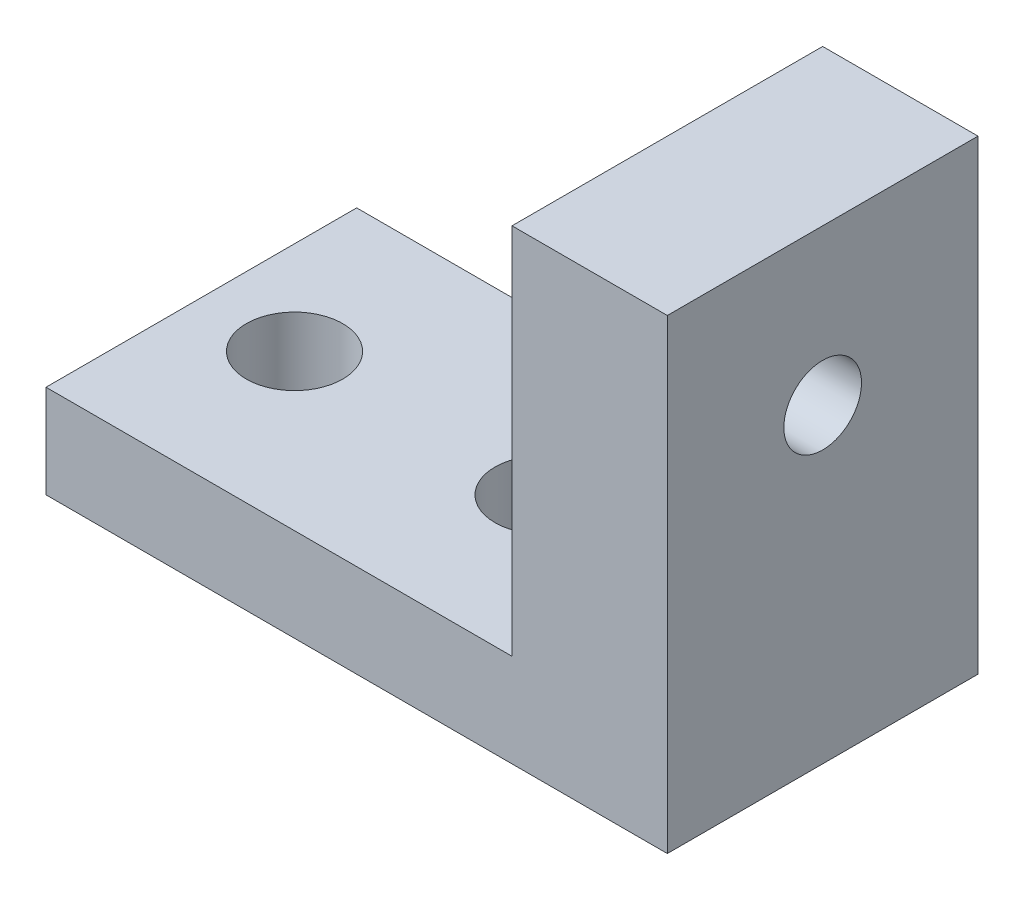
from build123d import *

# Parameters (mm, degrees)
SKETCH1_W                  = 10
SKETCH1_H                  = 15
BOSS_EXTRUDE1_DEPTH        = 20
M3X0_5_TAPPED_HOLE1_D      = 2.5
M3X0_5_TAPPED_HOLE1_DEPTH  = 7.5
M3X0_5_TAPPED_HOLE1_TIP    = 0.751075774
SKETCH6_W                  = 15
SKETCH6_H                  = 12
CUT_EXTRUDE1_DEPTH         = 27.925824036
F_3_1_3_1_DIAMETER_HOLE1_D = 3.1


with BuildPart() as part:
    # Sketch1 → Boss-Extrude1 (new body)
    with BuildSketch(Plane(origin=(0, 0, 0), x_dir=(0, 0, -1), z_dir=(1, 0, 0))):
        with Locations((5, 7.5)):
            Rectangle(SKETCH1_W, SKETCH1_H)
    extrude(amount=BOSS_EXTRUDE1_DEPTH)

    # M3x0.5 Tapped Hole1
    with Locations(Plane(origin=(20, 0, 0), x_dir=(0, 0, -1), z_dir=(1, 0, 0))):
        with Locations((5, 10)):
            Hole(M3X0_5_TAPPED_HOLE1_D / 2, depth=M3X0_5_TAPPED_HOLE1_DEPTH)
            with Locations((0, 0, -(M3X0_5_TAPPED_HOLE1_DEPTH + M3X0_5_TAPPED_HOLE1_TIP / 2))):  # 118° drill point
                Cone(0, M3X0_5_TAPPED_HOLE1_D / 2, M3X0_5_TAPPED_HOLE1_TIP, mode=Mode.SUBTRACT)

    # Sketch6 → Cut-Extrude1 (cut, through all)
    with BuildSketch(Plane.XY):
        with Locations((7.5, 9)):
            Rectangle(SKETCH6_W, SKETCH6_H)
    extrude(amount=-CUT_EXTRUDE1_DEPTH, mode=Mode.SUBTRACT)

    # 3.1 _3.1_ Diameter Hole1 (through all)
    with Locations(Plane(origin=(0, 3, 0), x_dir=(1, 0, 0), z_dir=(0, 1, 0))):
        with Locations((3, 5), (11, 5)):
            Hole(F_3_1_3_1_DIAMETER_HOLE1_D / 2)


solid = part.part
